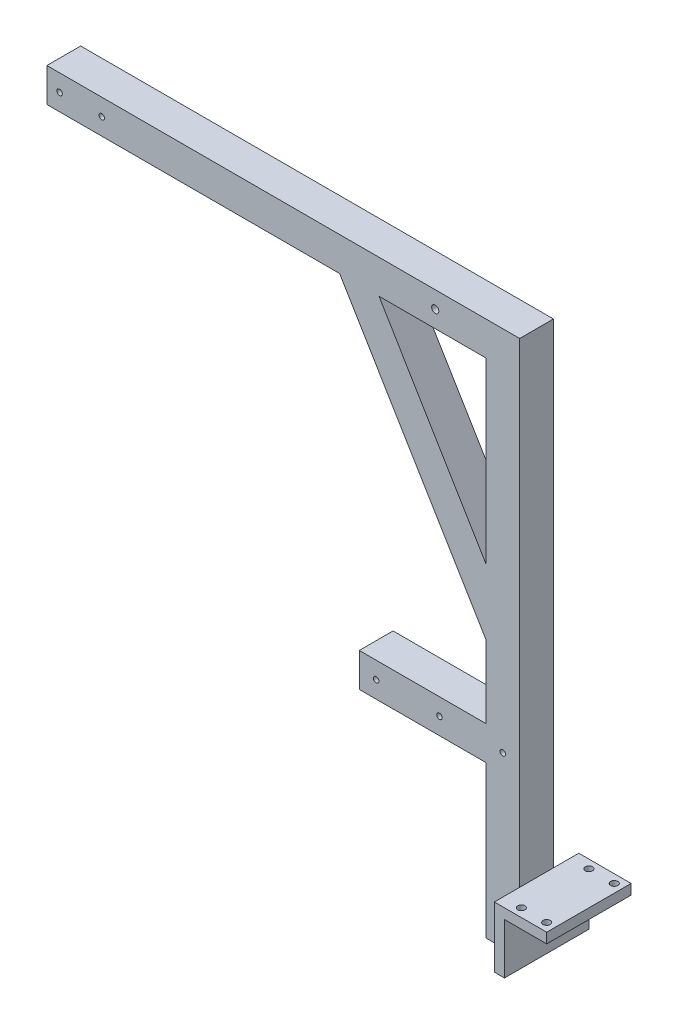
ISO-10303-21;
HEADER;
FILE_DESCRIPTION(('STEP AP214'),'2;1');
FILE_NAME('part.step','',(''),(''),'','','');
FILE_SCHEMA(('AUTOMOTIVE_DESIGN { 1 0 10303 214 1 1 1 1 }'));
ENDSEC;
DATA;
#1=APPLICATION_CONTEXT('core data for automotive mechanical design processes');
#2=APPLICATION_PROTOCOL_DEFINITION('international standard','automotive_design',2000,#1);
#3=PRODUCT_CONTEXT('',#1,'mechanical');
#4=PRODUCT('Part','Part','',(#3));
#5=PRODUCT_RELATED_PRODUCT_CATEGORY('part','',(#4));
#6=PRODUCT_DEFINITION_FORMATION('','',#4);
#7=PRODUCT_DEFINITION_CONTEXT('part definition',#1,'design');
#8=PRODUCT_DEFINITION('design','',#6,#7);
#9=PRODUCT_DEFINITION_SHAPE('','',#8);
#10=(LENGTH_UNIT() NAMED_UNIT(*) SI_UNIT(.MILLI.,.METRE.));
#11=(NAMED_UNIT(*) PLANE_ANGLE_UNIT() SI_UNIT($,.RADIAN.));
#12=(NAMED_UNIT(*) SI_UNIT($,.STERADIAN.) SOLID_ANGLE_UNIT());
#13=UNCERTAINTY_MEASURE_WITH_UNIT(LENGTH_MEASURE(1.E-05),#10,'distance_accuracy_value','');
#14=(GEOMETRIC_REPRESENTATION_CONTEXT(3) GLOBAL_UNCERTAINTY_ASSIGNED_CONTEXT((#13)) GLOBAL_UNIT_ASSIGNED_CONTEXT((#10,
#11,#12)) REPRESENTATION_CONTEXT('',''));
#15=CARTESIAN_POINT('',(0.,0.,0.));
#16=DIRECTION('',(0.,0.,1.));
#17=DIRECTION('',(1.,0.,0.));
#18=AXIS2_PLACEMENT_3D('',#15,#16,#17);
#19=CARTESIAN_POINT('',(560.,71.9999999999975,100.));
#20=DIRECTION('',(0.,0.,1.));
#21=DIRECTION('',(1.,0.,0.));
#22=AXIS2_PLACEMENT_3D('',#19,#20,#21);
#23=PLANE('',#22);
#24=DIRECTION('',(-1.,0.,0.));
#25=VECTOR('',#24,1.);
#26=CARTESIAN_POINT('',(560.,71.9999999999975,100.));
#27=LINE('',#26,#25);
#28=CARTESIAN_POINT('',(622.,71.9999999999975,100.));
#29=VERTEX_POINT('',#28);
#30=CARTESIAN_POINT('',(559.999999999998,71.9999999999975,100.));
#31=VERTEX_POINT('',#30);
#32=EDGE_CURVE('E192',#29,#31,#27,.T.);
#33=ORIENTED_EDGE('',*,*,#32,.T.);
#34=DIRECTION('',(0.,1.,0.));
#35=VECTOR('',#34,1.);
#36=CARTESIAN_POINT('',(559.999999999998,-2.77555756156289E-12,100.));
#37=LINE('',#36,#35);
#38=CARTESIAN_POINT('',(559.999999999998,-2.77555756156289E-12,100.));
#39=VERTEX_POINT('',#38);
#40=EDGE_CURVE('E180',#39,#31,#37,.T.);
#41=ORIENTED_EDGE('',*,*,#40,.F.);
#42=DIRECTION('',(1.,0.,0.));
#43=VECTOR('',#42,1.);
#44=CARTESIAN_POINT('',(520.,-2.50111042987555E-12,100.));
#45=LINE('',#44,#43);
#46=CARTESIAN_POINT('',(572.,-2.72848410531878E-12,100.));
#47=VERTEX_POINT('',#46);
#48=EDGE_CURVE('E189',#39,#47,#45,.T.);
#49=ORIENTED_EDGE('',*,*,#48,.T.);
#50=DIRECTION('',(0.,1.,0.));
#51=VECTOR('',#50,1.);
#52=CARTESIAN_POINT('',(572.,-2.72848410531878E-12,100.));
#53=LINE('',#52,#51);
#54=CARTESIAN_POINT('',(572.,59.9999999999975,100.));
#55=VERTEX_POINT('',#54);
#56=EDGE_CURVE('E201',#47,#55,#53,.T.);
#57=ORIENTED_EDGE('',*,*,#56,.T.);
#58=DIRECTION('',(1.,0.,0.));
#59=VECTOR('',#58,1.);
#60=CARTESIAN_POINT('',(572.,59.9999999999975,100.));
#61=LINE('',#60,#59);
#62=CARTESIAN_POINT('',(622.,59.9999999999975,100.));
#63=VERTEX_POINT('',#62);
#64=EDGE_CURVE('E204',#55,#63,#61,.T.);
#65=ORIENTED_EDGE('',*,*,#64,.T.);
#66=DIRECTION('',(0.,1.,0.));
#67=VECTOR('',#66,1.);
#68=CARTESIAN_POINT('',(622.,59.9999999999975,100.));
#69=LINE('',#68,#67);
#70=EDGE_CURVE('E214',#63,#29,#69,.T.);
#71=ORIENTED_EDGE('',*,*,#70,.T.);
#72=EDGE_LOOP('',(#33,#41,#49,#57,#65,#71));
#73=FACE_BOUND('',#72,.T.);
#74=ADVANCED_FACE('F33',(#73),#23,.T.);
#75=CARTESIAN_POINT('',(560.,71.9999999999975,0.));
#76=DIRECTION('',(0.,0.,1.));
#77=DIRECTION('',(1.,0.,0.));
#78=AXIS2_PLACEMENT_3D('',#75,#76,#77);
#79=PLANE('',#78);
#80=DIRECTION('',(0.,1.,0.));
#81=VECTOR('',#80,1.);
#82=CARTESIAN_POINT('',(559.999999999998,-2.77555756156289E-12,0.));
#83=LINE('',#82,#81);
#84=CARTESIAN_POINT('',(559.999999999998,-2.77555756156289E-12,0.));
#85=VERTEX_POINT('',#84);
#86=CARTESIAN_POINT('',(559.999999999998,71.9999999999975,0.));
#87=VERTEX_POINT('',#86);
#88=EDGE_CURVE('E194',#85,#87,#83,.T.);
#89=ORIENTED_EDGE('',*,*,#88,.T.);
#90=DIRECTION('',(-1.,0.,0.));
#91=VECTOR('',#90,1.);
#92=CARTESIAN_POINT('',(560.,71.9999999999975,0.));
#93=LINE('',#92,#91);
#94=CARTESIAN_POINT('',(622.,71.9999999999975,0.));
#95=VERTEX_POINT('',#94);
#96=EDGE_CURVE('E202',#95,#87,#93,.T.);
#97=ORIENTED_EDGE('',*,*,#96,.F.);
#98=DIRECTION('',(0.,1.,0.));
#99=VECTOR('',#98,1.);
#100=CARTESIAN_POINT('',(622.,59.9999999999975,0.));
#101=LINE('',#100,#99);
#102=CARTESIAN_POINT('',(622.,59.9999999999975,0.));
#103=VERTEX_POINT('',#102);
#104=EDGE_CURVE('E207',#103,#95,#101,.T.);
#105=ORIENTED_EDGE('',*,*,#104,.F.);
#106=DIRECTION('',(1.,0.,0.));
#107=VECTOR('',#106,1.);
#108=CARTESIAN_POINT('',(572.,59.9999999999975,0.));
#109=LINE('',#108,#107);
#110=CARTESIAN_POINT('',(572.,59.9999999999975,0.));
#111=VERTEX_POINT('',#110);
#112=EDGE_CURVE('E222',#111,#103,#109,.T.);
#113=ORIENTED_EDGE('',*,*,#112,.F.);
#114=DIRECTION('',(0.,1.,0.));
#115=VECTOR('',#114,1.);
#116=CARTESIAN_POINT('',(572.,-2.72848410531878E-12,0.));
#117=LINE('',#116,#115);
#118=CARTESIAN_POINT('',(572.,-2.72848410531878E-12,0.));
#119=VERTEX_POINT('',#118);
#120=EDGE_CURVE('E220',#119,#111,#117,.T.);
#121=ORIENTED_EDGE('',*,*,#120,.F.);
#122=DIRECTION('',(1.,0.,0.));
#123=VECTOR('',#122,1.);
#124=CARTESIAN_POINT('',(520.,-2.50111042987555E-12,0.));
#125=LINE('',#124,#123);
#126=EDGE_CURVE('E218',#85,#119,#125,.T.);
#127=ORIENTED_EDGE('',*,*,#126,.F.);
#128=EDGE_LOOP('',(#89,#97,#105,#113,#121,#127));
#129=FACE_BOUND('',#128,.T.);
#130=ADVANCED_FACE('F447',(#129),#79,.F.);
#131=CARTESIAN_POINT('',(0.,634.999999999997,100.));
#132=DIRECTION('',(0.,-1.,0.));
#133=DIRECTION('',(0.,0.,-1.));
#134=AXIS2_PLACEMENT_3D('',#131,#132,#133);
#135=PLANE('',#134);
#136=DIRECTION('',(-1.,0.,0.));
#137=VECTOR('',#136,1.);
#138=CARTESIAN_POINT('',(-1.81898940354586E-12,634.999999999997,30.));
#139=LINE('',#138,#137);
#140=CARTESIAN_POINT('',(560.,634.999999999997,30.));
#141=VERTEX_POINT('',#140);
#142=CARTESIAN_POINT('',(-1.81898940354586E-12,634.999999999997,30.));
#143=VERTEX_POINT('',#142);
#144=EDGE_CURVE('E58',#141,#143,#139,.T.);
#145=ORIENTED_EDGE('',*,*,#144,.T.);
#146=DIRECTION('',(0.,0.,-1.));
#147=VECTOR('',#146,1.);
#148=CARTESIAN_POINT('',(0.,634.999999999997,100.));
#149=LINE('',#148,#147);
#150=CARTESIAN_POINT('',(-1.83186799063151E-12,634.999999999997,70.));
#151=VERTEX_POINT('',#150);
#152=EDGE_CURVE('E262',#151,#143,#149,.T.);
#153=ORIENTED_EDGE('',*,*,#152,.F.);
#154=DIRECTION('',(1.,0.,0.));
#155=VECTOR('',#154,1.);
#156=CARTESIAN_POINT('',(-1.81898940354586E-12,634.999999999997,70.));
#157=LINE('',#156,#155);
#158=CARTESIAN_POINT('',(559.999999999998,634.999999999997,70.));
#159=VERTEX_POINT('',#158);
#160=EDGE_CURVE('E290',#151,#159,#157,.T.);
#161=ORIENTED_EDGE('',*,*,#160,.T.);
#162=DIRECTION('',(0.,0.,-1.));
#163=VECTOR('',#162,1.);
#164=CARTESIAN_POINT('',(560.,634.999999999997,100.));
#165=LINE('',#164,#163);
#166=EDGE_CURVE('E265',#159,#141,#165,.T.);
#167=ORIENTED_EDGE('',*,*,#166,.T.);
#168=EDGE_LOOP('',(#145,#153,#161,#167));
#169=FACE_BOUND('',#168,.T.);
#170=ADVANCED_FACE('F35',(#169),#135,.F.);
#171=CARTESIAN_POINT('',(0.,634.999999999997,100.));
#172=DIRECTION('',(1.,0.,0.));
#173=DIRECTION('',(0.,0.,-1.));
#174=AXIS2_PLACEMENT_3D('',#171,#172,#173);
#175=PLANE('',#174);
#176=DIRECTION('',(0.,1.,0.));
#177=VECTOR('',#176,1.);
#178=CARTESIAN_POINT('',(-1.81898940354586E-12,-2.77555756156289E-12,30.));
#179=LINE('',#178,#177);
#180=CARTESIAN_POINT('',(-1.81898940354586E-12,594.999999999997,30.));
#181=VERTEX_POINT('',#180);
#182=EDGE_CURVE('E333',#181,#143,#179,.T.);
#183=ORIENTED_EDGE('',*,*,#182,.F.);
#184=DIRECTION('',(0.,0.,-1.));
#185=VECTOR('',#184,1.);
#186=CARTESIAN_POINT('',(0.,594.999999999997,100.));
#187=LINE('',#186,#185);
#188=CARTESIAN_POINT('',(-1.81898940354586E-12,594.999999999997,70.));
#189=VERTEX_POINT('',#188);
#190=EDGE_CURVE('E259',#189,#181,#187,.T.);
#191=ORIENTED_EDGE('',*,*,#190,.F.);
#192=DIRECTION('',(0.,1.,0.));
#193=VECTOR('',#192,1.);
#194=CARTESIAN_POINT('',(-1.81898940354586E-12,-2.77555756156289E-12,70.));
#195=LINE('',#194,#193);
#196=EDGE_CURVE('E329',#189,#151,#195,.T.);
#197=ORIENTED_EDGE('',*,*,#196,.T.);
#198=ORIENTED_EDGE('',*,*,#152,.T.);
#199=EDGE_LOOP('',(#183,#191,#197,#198));
#200=FACE_BOUND('',#199,.T.);
#201=ADVANCED_FACE('F428',(#200),#175,.F.);
#202=CARTESIAN_POINT('',(0.,594.999999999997,100.));
#203=DIRECTION('',(0.,1.,0.));
#204=DIRECTION('',(0.,0.,1.));
#205=AXIS2_PLACEMENT_3D('',#202,#203,#204);
#206=PLANE('',#205);
#207=DIRECTION('',(-1.,0.,0.));
#208=VECTOR('',#207,1.);
#209=CARTESIAN_POINT('',(0.,594.999999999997,30.));
#210=LINE('',#209,#208);
#211=CARTESIAN_POINT('',(346.676192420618,594.999999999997,30.));
#212=VERTEX_POINT('',#211);
#213=EDGE_CURVE('E284',#212,#181,#210,.T.);
#214=ORIENTED_EDGE('',*,*,#213,.F.);
#215=DIRECTION('',(0.,0.,-1.));
#216=VECTOR('',#215,1.);
#217=CARTESIAN_POINT('',(346.676192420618,594.999999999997,100.));
#218=LINE('',#217,#216);
#219=CARTESIAN_POINT('',(346.676192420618,594.999999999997,70.));
#220=VERTEX_POINT('',#219);
#221=EDGE_CURVE('E256',#220,#212,#218,.T.);
#222=ORIENTED_EDGE('',*,*,#221,.F.);
#223=DIRECTION('',(1.,0.,0.));
#224=VECTOR('',#223,1.);
#225=CARTESIAN_POINT('',(0.,594.999999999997,70.));
#226=LINE('',#225,#224);
#227=EDGE_CURVE('E363',#189,#220,#226,.T.);
#228=ORIENTED_EDGE('',*,*,#227,.F.);
#229=ORIENTED_EDGE('',*,*,#190,.T.);
#230=EDGE_LOOP('',(#214,#222,#228,#229));
#231=FACE_BOUND('',#230,.T.);
#232=ADVANCED_FACE('F425',(#231),#206,.F.);
#233=CARTESIAN_POINT('',(346.676192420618,594.999999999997,100.));
#234=DIRECTION('',(0.857492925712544,0.514495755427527,0.));
#235=DIRECTION('',(-0.514495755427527,0.857492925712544,0.));
#236=AXIS2_PLACEMENT_3D('',#233,#234,#235);
#237=PLANE('',#236);
#238=DIRECTION('',(-0.514495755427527,0.857492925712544,0.));
#239=VECTOR('',#238,1.);
#240=CARTESIAN_POINT('',(346.676192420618,594.999999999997,30.));
#241=LINE('',#240,#239);
#242=CARTESIAN_POINT('',(520.,306.126987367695,30.));
#243=VERTEX_POINT('',#242);
#244=EDGE_CURVE('E381',#243,#212,#241,.T.);
#245=ORIENTED_EDGE('',*,*,#244,.F.);
#246=DIRECTION('',(0.,0.,-1.));
#247=VECTOR('',#246,1.);
#248=CARTESIAN_POINT('',(520.,306.126987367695,100.));
#249=LINE('',#248,#247);
#250=CARTESIAN_POINT('',(520.,306.126987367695,70.));
#251=VERTEX_POINT('',#250);
#252=EDGE_CURVE('E253',#251,#243,#249,.T.);
#253=ORIENTED_EDGE('',*,*,#252,.F.);
#254=DIRECTION('',(0.514495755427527,-0.857492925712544,0.));
#255=VECTOR('',#254,1.);
#256=CARTESIAN_POINT('',(346.676192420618,594.999999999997,70.));
#257=LINE('',#256,#255);
#258=EDGE_CURVE('E361',#220,#251,#257,.T.);
#259=ORIENTED_EDGE('',*,*,#258,.F.);
#260=ORIENTED_EDGE('',*,*,#221,.T.);
#261=EDGE_LOOP('',(#245,#253,#259,#260));
#262=FACE_BOUND('',#261,.T.);
#263=ADVANCED_FACE('F423',(#262),#237,.F.);
#264=CARTESIAN_POINT('',(520.,306.126987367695,100.));
#265=DIRECTION('',(1.,0.,0.));
#266=DIRECTION('',(0.,0.,-1.));
#267=AXIS2_PLACEMENT_3D('',#264,#265,#266);
#268=PLANE('',#267);
#269=DIRECTION('',(0.,1.,0.));
#270=VECTOR('',#269,1.);
#271=CARTESIAN_POINT('',(520.,306.126987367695,30.));
#272=LINE('',#271,#270);
#273=CARTESIAN_POINT('',(520.,219.999999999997,30.));
#274=VERTEX_POINT('',#273);
#275=EDGE_CURVE('E379',#274,#243,#272,.T.);
#276=ORIENTED_EDGE('',*,*,#275,.F.);
#277=DIRECTION('',(0.,0.,-1.));
#278=VECTOR('',#277,1.);
#279=CARTESIAN_POINT('',(520.,219.999999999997,100.));
#280=LINE('',#279,#278);
#281=CARTESIAN_POINT('',(520.,219.999999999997,70.));
#282=VERTEX_POINT('',#281);
#283=EDGE_CURVE('E250',#282,#274,#280,.T.);
#284=ORIENTED_EDGE('',*,*,#283,.F.);
#285=DIRECTION('',(0.,-1.,0.));
#286=VECTOR('',#285,1.);
#287=CARTESIAN_POINT('',(520.,306.126987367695,70.));
#288=LINE('',#287,#286);
#289=EDGE_CURVE('E359',#251,#282,#288,.T.);
#290=ORIENTED_EDGE('',*,*,#289,.F.);
#291=ORIENTED_EDGE('',*,*,#252,.T.);
#292=EDGE_LOOP('',(#276,#284,#290,#291));
#293=FACE_BOUND('',#292,.T.);
#294=ADVANCED_FACE('F474',(#293),#268,.F.);
#295=CARTESIAN_POINT('',(520.,219.999999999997,100.));
#296=DIRECTION('',(0.,-1.,0.));
#297=DIRECTION('',(0.,0.,-1.));
#298=AXIS2_PLACEMENT_3D('',#295,#296,#297);
#299=PLANE('',#298);
#300=DIRECTION('',(1.,0.,0.));
#301=VECTOR('',#300,1.);
#302=CARTESIAN_POINT('',(520.,219.999999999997,30.));
#303=LINE('',#302,#301);
#304=CARTESIAN_POINT('',(370.,219.999999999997,30.));
#305=VERTEX_POINT('',#304);
#306=EDGE_CURVE('E377',#305,#274,#303,.T.);
#307=ORIENTED_EDGE('',*,*,#306,.F.);
#308=DIRECTION('',(0.,0.,-1.));
#309=VECTOR('',#308,1.);
#310=CARTESIAN_POINT('',(370.,219.999999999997,100.));
#311=LINE('',#310,#309);
#312=CARTESIAN_POINT('',(370.,219.999999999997,70.));
#313=VERTEX_POINT('',#312);
#314=EDGE_CURVE('E247',#313,#305,#311,.T.);
#315=ORIENTED_EDGE('',*,*,#314,.F.);
#316=DIRECTION('',(-1.,0.,0.));
#317=VECTOR('',#316,1.);
#318=CARTESIAN_POINT('',(520.,219.999999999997,70.));
#319=LINE('',#318,#317);
#320=EDGE_CURVE('E357',#282,#313,#319,.T.);
#321=ORIENTED_EDGE('',*,*,#320,.F.);
#322=ORIENTED_EDGE('',*,*,#283,.T.);
#323=EDGE_LOOP('',(#307,#315,#321,#322));
#324=FACE_BOUND('',#323,.T.);
#325=ADVANCED_FACE('F470',(#324),#299,.F.);
#326=CARTESIAN_POINT('',(370.,179.999999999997,100.));
#327=DIRECTION('',(1.,0.,0.));
#328=DIRECTION('',(0.,0.,-1.));
#329=AXIS2_PLACEMENT_3D('',#326,#327,#328);
#330=PLANE('',#329);
#331=DIRECTION('',(0.,1.,0.));
#332=VECTOR('',#331,1.);
#333=CARTESIAN_POINT('',(370.,179.999999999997,30.));
#334=LINE('',#333,#332);
#335=CARTESIAN_POINT('',(370.,179.999999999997,30.));
#336=VERTEX_POINT('',#335);
#337=EDGE_CURVE('E375',#336,#305,#334,.T.);
#338=ORIENTED_EDGE('',*,*,#337,.F.);
#339=DIRECTION('',(0.,0.,-1.));
#340=VECTOR('',#339,1.);
#341=CARTESIAN_POINT('',(370.,179.999999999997,100.));
#342=LINE('',#341,#340);
#343=CARTESIAN_POINT('',(370.,179.999999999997,70.));
#344=VERTEX_POINT('',#343);
#345=EDGE_CURVE('E244',#344,#336,#342,.T.);
#346=ORIENTED_EDGE('',*,*,#345,.F.);
#347=DIRECTION('',(0.,-1.,0.));
#348=VECTOR('',#347,1.);
#349=CARTESIAN_POINT('',(370.,179.999999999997,70.));
#350=LINE('',#349,#348);
#351=EDGE_CURVE('E355',#313,#344,#350,.T.);
#352=ORIENTED_EDGE('',*,*,#351,.F.);
#353=ORIENTED_EDGE('',*,*,#314,.T.);
#354=EDGE_LOOP('',(#338,#346,#352,#353));
#355=FACE_BOUND('',#354,.T.);
#356=ADVANCED_FACE('F465',(#355),#330,.F.);
#357=CARTESIAN_POINT('',(520.,179.999999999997,100.));
#358=DIRECTION('',(0.,1.,0.));
#359=DIRECTION('',(0.,0.,1.));
#360=AXIS2_PLACEMENT_3D('',#357,#358,#359);
#361=PLANE('',#360);
#362=DIRECTION('',(-1.,0.,0.));
#363=VECTOR('',#362,1.);
#364=CARTESIAN_POINT('',(520.,179.999999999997,30.));
#365=LINE('',#364,#363);
#366=CARTESIAN_POINT('',(520.,179.999999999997,30.));
#367=VERTEX_POINT('',#366);
#368=EDGE_CURVE('E373',#367,#336,#365,.T.);
#369=ORIENTED_EDGE('',*,*,#368,.F.);
#370=DIRECTION('',(0.,0.,-1.));
#371=VECTOR('',#370,1.);
#372=CARTESIAN_POINT('',(520.,179.999999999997,100.));
#373=LINE('',#372,#371);
#374=CARTESIAN_POINT('',(520.,179.999999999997,70.));
#375=VERTEX_POINT('',#374);
#376=EDGE_CURVE('E241',#375,#367,#373,.T.);
#377=ORIENTED_EDGE('',*,*,#376,.F.);
#378=DIRECTION('',(1.,0.,0.));
#379=VECTOR('',#378,1.);
#380=CARTESIAN_POINT('',(520.,179.999999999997,70.));
#381=LINE('',#380,#379);
#382=EDGE_CURVE('E353',#344,#375,#381,.T.);
#383=ORIENTED_EDGE('',*,*,#382,.F.);
#384=ORIENTED_EDGE('',*,*,#345,.T.);
#385=EDGE_LOOP('',(#369,#377,#383,#384));
#386=FACE_BOUND('',#385,.T.);
#387=ADVANCED_FACE('F460',(#386),#361,.F.);
#388=CARTESIAN_POINT('',(520.,-2.50111042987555E-12,100.));
#389=DIRECTION('',(1.,0.,0.));
#390=DIRECTION('',(0.,0.,-1.));
#391=AXIS2_PLACEMENT_3D('',#388,#389,#390);
#392=PLANE('',#391);
#393=DIRECTION('',(0.,1.,0.));
#394=VECTOR('',#393,1.);
#395=CARTESIAN_POINT('',(520.,-2.50111042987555E-12,30.));
#396=LINE('',#395,#394);
#397=CARTESIAN_POINT('',(520.,-2.77555756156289E-12,30.));
#398=VERTEX_POINT('',#397);
#399=EDGE_CURVE('E371',#398,#367,#396,.T.);
#400=ORIENTED_EDGE('',*,*,#399,.F.);
#401=DIRECTION('',(0.,0.,-1.));
#402=VECTOR('',#401,1.);
#403=CARTESIAN_POINT('',(520.,-2.50111042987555E-12,100.));
#404=LINE('',#403,#402);
#405=CARTESIAN_POINT('',(520.,-2.77555756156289E-12,70.));
#406=VERTEX_POINT('',#405);
#407=EDGE_CURVE('E238',#406,#398,#404,.T.);
#408=ORIENTED_EDGE('',*,*,#407,.F.);
#409=DIRECTION('',(0.,-1.,0.));
#410=VECTOR('',#409,1.);
#411=CARTESIAN_POINT('',(520.,-2.50111042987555E-12,70.));
#412=LINE('',#411,#410);
#413=EDGE_CURVE('E351',#375,#406,#412,.T.);
#414=ORIENTED_EDGE('',*,*,#413,.F.);
#415=ORIENTED_EDGE('',*,*,#376,.T.);
#416=EDGE_LOOP('',(#400,#408,#414,#415));
#417=FACE_BOUND('',#416,.T.);
#418=ADVANCED_FACE('F455',(#417),#392,.F.);
#419=CARTESIAN_POINT('',(520.,-2.50111042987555E-12,100.));
#420=DIRECTION('',(0.,1.,0.));
#421=DIRECTION('',(-1.,0.,0.));
#422=AXIS2_PLACEMENT_3D('',#419,#420,#421);
#423=PLANE('',#422);
#424=DIRECTION('',(-1.,0.,0.));
#425=VECTOR('',#424,1.);
#426=CARTESIAN_POINT('',(-1.81898940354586E-12,-2.77555756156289E-12,30.));
#427=LINE('',#426,#425);
#428=CARTESIAN_POINT('',(559.999999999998,-2.77555756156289E-12,30.));
#429=VERTEX_POINT('',#428);
#430=EDGE_CURVE('E327',#429,#398,#427,.T.);
#431=ORIENTED_EDGE('',*,*,#430,.F.);
#432=DIRECTION('',(0.,0.,1.));
#433=VECTOR('',#432,1.);
#434=CARTESIAN_POINT('',(559.999999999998,-2.77555756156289E-12,30.));
#435=LINE('',#434,#433);
#436=EDGE_CURVE('E185',#85,#429,#435,.T.);
#437=ORIENTED_EDGE('',*,*,#436,.F.);
#438=ORIENTED_EDGE('',*,*,#126,.T.);
#439=DIRECTION('',(0.,0.,-1.));
#440=VECTOR('',#439,1.);
#441=CARTESIAN_POINT('',(572.,-2.72848410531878E-12,100.));
#442=LINE('',#441,#440);
#443=EDGE_CURVE('E199',#47,#119,#442,.T.);
#444=ORIENTED_EDGE('',*,*,#443,.F.);
#445=ORIENTED_EDGE('',*,*,#48,.F.);
#446=DIRECTION('',(0.,0.,1.));
#447=VECTOR('',#446,1.);
#448=CARTESIAN_POINT('',(559.999999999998,-2.77555756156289E-12,100.));
#449=LINE('',#448,#447);
#450=CARTESIAN_POINT('',(559.999999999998,-2.77555756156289E-12,70.));
#451=VERTEX_POINT('',#450);
#452=EDGE_CURVE('E177',#451,#39,#449,.T.);
#453=ORIENTED_EDGE('',*,*,#452,.F.);
#454=DIRECTION('',(1.,0.,0.));
#455=VECTOR('',#454,1.);
#456=CARTESIAN_POINT('',(-1.81898940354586E-12,-2.77555756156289E-12,70.));
#457=LINE('',#456,#455);
#458=EDGE_CURVE('E186',#406,#451,#457,.T.);
#459=ORIENTED_EDGE('',*,*,#458,.F.);
#460=ORIENTED_EDGE('',*,*,#407,.T.);
#461=EDGE_LOOP('',(#431,#437,#438,#444,#445,#453,#459,#460));
#462=FACE_BOUND('',#461,.T.);
#463=ADVANCED_FACE('F197',(#462),#423,.F.);
#464=CARTESIAN_POINT('',(560.,71.9999999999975,100.));
#465=DIRECTION('',(-1.,0.,0.));
#466=DIRECTION('',(0.,0.,1.));
#467=AXIS2_PLACEMENT_3D('',#464,#465,#466);
#468=PLANE('',#467);
#469=DIRECTION('',(0.,1.,0.));
#470=VECTOR('',#469,1.);
#471=CARTESIAN_POINT('',(559.999999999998,-2.77555756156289E-12,30.));
#472=LINE('',#471,#470);
#473=CARTESIAN_POINT('',(559.999999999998,71.9999999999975,30.));
#474=VERTEX_POINT('',#473);
#475=EDGE_CURVE('E339',#474,#141,#472,.T.);
#476=ORIENTED_EDGE('',*,*,#475,.T.);
#477=ORIENTED_EDGE('',*,*,#166,.F.);
#478=DIRECTION('',(0.,1.,0.));
#479=VECTOR('',#478,1.);
#480=CARTESIAN_POINT('',(559.999999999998,-2.77555756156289E-12,70.));
#481=LINE('',#480,#479);
#482=CARTESIAN_POINT('',(560.,71.9999999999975,70.));
#483=VERTEX_POINT('',#482);
#484=EDGE_CURVE('E343',#483,#159,#481,.T.);
#485=ORIENTED_EDGE('',*,*,#484,.F.);
#486=DIRECTION('',(0.,0.,-1.));
#487=VECTOR('',#486,1.);
#488=CARTESIAN_POINT('',(560.,71.9999999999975,100.));
#489=LINE('',#488,#487);
#490=EDGE_CURVE('E228',#483,#474,#489,.T.);
#491=ORIENTED_EDGE('',*,*,#490,.T.);
#492=EDGE_LOOP('',(#476,#477,#485,#491));
#493=FACE_BOUND('',#492,.T.);
#494=ADVANCED_FACE('F434',(#493),#468,.F.);
#495=CARTESIAN_POINT('',(572.,-2.72848410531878E-12,100.));
#496=DIRECTION('',(-1.,0.,0.));
#497=DIRECTION('',(0.,0.,1.));
#498=AXIS2_PLACEMENT_3D('',#495,#496,#497);
#499=PLANE('',#498);
#500=ORIENTED_EDGE('',*,*,#120,.T.);
#501=DIRECTION('',(0.,0.,-1.));
#502=VECTOR('',#501,1.);
#503=CARTESIAN_POINT('',(572.,59.9999999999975,100.));
#504=LINE('',#503,#502);
#505=EDGE_CURVE('E234',#55,#111,#504,.T.);
#506=ORIENTED_EDGE('',*,*,#505,.F.);
#507=ORIENTED_EDGE('',*,*,#56,.F.);
#508=ORIENTED_EDGE('',*,*,#443,.T.);
#509=EDGE_LOOP('',(#500,#506,#507,#508));
#510=FACE_BOUND('',#509,.T.);
#511=ADVANCED_FACE('F494',(#510),#499,.F.);
#512=CARTESIAN_POINT('',(572.,59.9999999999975,100.));
#513=DIRECTION('',(0.,1.,0.));
#514=DIRECTION('',(0.,0.,1.));
#515=AXIS2_PLACEMENT_3D('',#512,#513,#514);
#516=PLANE('',#515);
#517=CARTESIAN_POINT('',(581.999999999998,59.9999999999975,90.));
#518=DIRECTION('',(0.,1.,0.));
#519=DIRECTION('',(0.,0.,1.));
#520=AXIS2_PLACEMENT_3D('',#517,#518,#519);
#521=CIRCLE('',#520,4.24999999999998);
#522=CARTESIAN_POINT('',(581.999999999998,59.9999999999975,94.25));
#523=VERTEX_POINT('',#522);
#524=EDGE_CURVE('E280',#523,#523,#521,.T.);
#525=ORIENTED_EDGE('',*,*,#524,.T.);
#526=EDGE_LOOP('',(#525));
#527=FACE_BOUND('',#526,.T.);
#528=CARTESIAN_POINT('',(611.999999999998,59.9999999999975,90.));
#529=DIRECTION('',(0.,1.,0.));
#530=DIRECTION('',(0.,0.,1.));
#531=AXIS2_PLACEMENT_3D('',#528,#529,#530);
#532=CIRCLE('',#531,4.24999999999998);
#533=CARTESIAN_POINT('',(611.999999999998,59.9999999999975,94.25));
#534=VERTEX_POINT('',#533);
#535=EDGE_CURVE('E276',#534,#534,#532,.T.);
#536=ORIENTED_EDGE('',*,*,#535,.T.);
#537=EDGE_LOOP('',(#536));
#538=FACE_BOUND('',#537,.T.);
#539=CARTESIAN_POINT('',(611.999999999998,59.9999999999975,10.));
#540=DIRECTION('',(0.,1.,0.));
#541=DIRECTION('',(0.,0.,1.));
#542=AXIS2_PLACEMENT_3D('',#539,#540,#541);
#543=CIRCLE('',#542,4.24999999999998);
#544=CARTESIAN_POINT('',(611.999999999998,59.9999999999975,14.25));
#545=VERTEX_POINT('',#544);
#546=EDGE_CURVE('E272',#545,#545,#543,.T.);
#547=ORIENTED_EDGE('',*,*,#546,.T.);
#548=EDGE_LOOP('',(#547));
#549=FACE_BOUND('',#548,.T.);
#550=CARTESIAN_POINT('',(581.999999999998,59.9999999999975,10.));
#551=DIRECTION('',(0.,1.,0.));
#552=DIRECTION('',(0.,0.,1.));
#553=AXIS2_PLACEMENT_3D('',#550,#551,#552);
#554=CIRCLE('',#553,4.24999999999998);
#555=CARTESIAN_POINT('',(581.999999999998,59.9999999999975,14.25));
#556=VERTEX_POINT('',#555);
#557=EDGE_CURVE('E271',#556,#556,#554,.T.);
#558=ORIENTED_EDGE('',*,*,#557,.T.);
#559=EDGE_LOOP('',(#558));
#560=FACE_BOUND('',#559,.T.);
#561=ORIENTED_EDGE('',*,*,#112,.T.);
#562=DIRECTION('',(0.,0.,-1.));
#563=VECTOR('',#562,1.);
#564=CARTESIAN_POINT('',(622.,59.9999999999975,100.));
#565=LINE('',#564,#563);
#566=EDGE_CURVE('E231',#63,#103,#565,.T.);
#567=ORIENTED_EDGE('',*,*,#566,.F.);
#568=ORIENTED_EDGE('',*,*,#64,.F.);
#569=ORIENTED_EDGE('',*,*,#505,.T.);
#570=EDGE_LOOP('',(#561,#567,#568,#569));
#571=FACE_BOUND('',#570,.T.);
#572=ADVANCED_FACE('F502',(#527,#538,#549,#560,#571),#516,.F.);
#573=CARTESIAN_POINT('',(622.,59.9999999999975,100.));
#574=DIRECTION('',(-1.,0.,0.));
#575=DIRECTION('',(0.,0.,1.));
#576=AXIS2_PLACEMENT_3D('',#573,#574,#575);
#577=PLANE('',#576);
#578=ORIENTED_EDGE('',*,*,#104,.T.);
#579=DIRECTION('',(0.,0.,-1.));
#580=VECTOR('',#579,1.);
#581=CARTESIAN_POINT('',(622.,71.9999999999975,100.));
#582=LINE('',#581,#580);
#583=EDGE_CURVE('E227',#29,#95,#582,.T.);
#584=ORIENTED_EDGE('',*,*,#583,.F.);
#585=ORIENTED_EDGE('',*,*,#70,.F.);
#586=ORIENTED_EDGE('',*,*,#566,.T.);
#587=EDGE_LOOP('',(#578,#584,#585,#586));
#588=FACE_BOUND('',#587,.T.);
#589=ADVANCED_FACE('F498',(#588),#577,.F.);
#590=CARTESIAN_POINT('',(560.,71.9999999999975,100.));
#591=DIRECTION('',(0.,-1.,0.));
#592=DIRECTION('',(0.,0.,-1.));
#593=AXIS2_PLACEMENT_3D('',#590,#591,#592);
#594=PLANE('',#593);
#595=CARTESIAN_POINT('',(581.999999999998,71.9999999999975,90.));
#596=DIRECTION('',(0.,-1.,0.));
#597=DIRECTION('',(0.,0.,-1.));
#598=AXIS2_PLACEMENT_3D('',#595,#596,#597);
#599=CIRCLE('',#598,4.24999999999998);
#600=CARTESIAN_POINT('',(581.999999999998,71.9999999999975,94.25));
#601=VERTEX_POINT('',#600);
#602=EDGE_CURVE('E281',#601,#601,#599,.T.);
#603=ORIENTED_EDGE('',*,*,#602,.T.);
#604=EDGE_LOOP('',(#603));
#605=FACE_BOUND('',#604,.T.);
#606=CARTESIAN_POINT('',(611.999999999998,71.9999999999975,90.));
#607=DIRECTION('',(0.,-1.,0.));
#608=DIRECTION('',(0.,0.,-1.));
#609=AXIS2_PLACEMENT_3D('',#606,#607,#608);
#610=CIRCLE('',#609,4.24999999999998);
#611=CARTESIAN_POINT('',(611.999999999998,71.9999999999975,94.25));
#612=VERTEX_POINT('',#611);
#613=EDGE_CURVE('E277',#612,#612,#610,.T.);
#614=ORIENTED_EDGE('',*,*,#613,.T.);
#615=EDGE_LOOP('',(#614));
#616=FACE_BOUND('',#615,.T.);
#617=CARTESIAN_POINT('',(611.999999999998,71.9999999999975,10.));
#618=DIRECTION('',(0.,-1.,0.));
#619=DIRECTION('',(0.,0.,-1.));
#620=AXIS2_PLACEMENT_3D('',#617,#618,#619);
#621=CIRCLE('',#620,4.24999999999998);
#622=CARTESIAN_POINT('',(611.999999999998,71.9999999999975,14.25));
#623=VERTEX_POINT('',#622);
#624=EDGE_CURVE('E273',#623,#623,#621,.T.);
#625=ORIENTED_EDGE('',*,*,#624,.T.);
#626=EDGE_LOOP('',(#625));
#627=FACE_BOUND('',#626,.T.);
#628=CARTESIAN_POINT('',(581.999999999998,71.9999999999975,10.));
#629=DIRECTION('',(0.,-1.,0.));
#630=DIRECTION('',(0.,0.,-1.));
#631=AXIS2_PLACEMENT_3D('',#628,#629,#630);
#632=CIRCLE('',#631,4.24999999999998);
#633=CARTESIAN_POINT('',(581.999999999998,71.9999999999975,14.25));
#634=VERTEX_POINT('',#633);
#635=EDGE_CURVE('E268',#634,#634,#632,.T.);
#636=ORIENTED_EDGE('',*,*,#635,.T.);
#637=EDGE_LOOP('',(#636));
#638=FACE_BOUND('',#637,.T.);
#639=ORIENTED_EDGE('',*,*,#96,.T.);
#640=EDGE_CURVE('E217',#474,#87,#489,.T.);
#641=ORIENTED_EDGE('',*,*,#640,.F.);
#642=ORIENTED_EDGE('',*,*,#490,.F.);
#643=EDGE_CURVE('E225',#31,#483,#489,.T.);
#644=ORIENTED_EDGE('',*,*,#643,.F.);
#645=ORIENTED_EDGE('',*,*,#32,.F.);
#646=ORIENTED_EDGE('',*,*,#583,.T.);
#647=EDGE_LOOP('',(#639,#641,#642,#644,#645,#646));
#648=FACE_BOUND('',#647,.T.);
#649=ADVANCED_FACE('F442',(#605,#616,#627,#638,#648),#594,.F.);
#650=CARTESIAN_POINT('',(581.999999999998,-2.77555756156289E-12,10.));
#651=DIRECTION('',(0.,1.,0.));
#652=DIRECTION('',(0.,0.,1.));
#653=AXIS2_PLACEMENT_3D('',#650,#651,#652);
#654=CYLINDRICAL_SURFACE('',#653,4.24999999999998);
#655=CARTESIAN_POINT('',(581.999999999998,71.9999999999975,14.25));
#656=CARTESIAN_POINT('',(581.999999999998,71.8749999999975,14.25));
#657=CARTESIAN_POINT('',(581.999999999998,71.7499999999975,14.25));
#658=CARTESIAN_POINT('',(581.999999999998,71.4999999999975,14.25));
#659=CARTESIAN_POINT('',(581.999999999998,71.3749999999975,14.25));
#660=CARTESIAN_POINT('',(581.999999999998,71.1249999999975,14.25));
#661=CARTESIAN_POINT('',(581.999999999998,70.9999999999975,14.25));
#662=CARTESIAN_POINT('',(581.999999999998,70.7499999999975,14.25));
#663=CARTESIAN_POINT('',(581.999999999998,70.6249999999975,14.25));
#664=CARTESIAN_POINT('',(581.999999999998,70.3749999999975,14.25));
#665=CARTESIAN_POINT('',(581.999999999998,70.2499999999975,14.25));
#666=CARTESIAN_POINT('',(581.999999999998,69.9999999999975,14.25));
#667=CARTESIAN_POINT('',(581.999999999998,69.8749999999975,14.25));
#668=CARTESIAN_POINT('',(581.999999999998,69.6249999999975,14.25));
#669=CARTESIAN_POINT('',(581.999999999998,69.4999999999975,14.25));
#670=CARTESIAN_POINT('',(581.999999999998,69.2499999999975,14.25));
#671=CARTESIAN_POINT('',(581.999999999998,69.1249999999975,14.25));
#672=CARTESIAN_POINT('',(581.999999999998,68.8749999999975,14.25));
#673=CARTESIAN_POINT('',(581.999999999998,68.7499999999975,14.25));
#674=CARTESIAN_POINT('',(581.999999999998,68.4999999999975,14.25));
#675=CARTESIAN_POINT('',(581.999999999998,68.3749999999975,14.25));
#676=CARTESIAN_POINT('',(581.999999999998,68.1249999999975,14.25));
#677=CARTESIAN_POINT('',(581.999999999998,67.9999999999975,14.25));
#678=CARTESIAN_POINT('',(581.999999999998,67.7499999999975,14.25));
#679=CARTESIAN_POINT('',(581.999999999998,67.6249999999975,14.25));
#680=CARTESIAN_POINT('',(581.999999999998,67.3749999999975,14.25));
#681=CARTESIAN_POINT('',(581.999999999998,67.2499999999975,14.25));
#682=CARTESIAN_POINT('',(581.999999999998,66.9999999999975,14.25));
#683=CARTESIAN_POINT('',(581.999999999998,66.8749999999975,14.25));
#684=CARTESIAN_POINT('',(581.999999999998,66.6249999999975,14.25));
#685=CARTESIAN_POINT('',(581.999999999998,66.4999999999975,14.25));
#686=CARTESIAN_POINT('',(581.999999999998,66.2499999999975,14.25));
#687=CARTESIAN_POINT('',(581.999999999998,66.1249999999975,14.25));
#688=CARTESIAN_POINT('',(581.999999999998,65.8749999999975,14.25));
#689=CARTESIAN_POINT('',(581.999999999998,65.7499999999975,14.25));
#690=CARTESIAN_POINT('',(581.999999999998,65.4999999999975,14.25));
#691=CARTESIAN_POINT('',(581.999999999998,65.3749999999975,14.25));
#692=CARTESIAN_POINT('',(581.999999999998,65.1249999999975,14.25));
#693=CARTESIAN_POINT('',(581.999999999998,64.9999999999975,14.25));
#694=CARTESIAN_POINT('',(581.999999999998,64.7499999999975,14.25));
#695=CARTESIAN_POINT('',(581.999999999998,64.6249999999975,14.25));
#696=CARTESIAN_POINT('',(581.999999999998,64.3749999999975,14.25));
#697=CARTESIAN_POINT('',(581.999999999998,64.2499999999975,14.25));
#698=CARTESIAN_POINT('',(581.999999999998,63.9999999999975,14.25));
#699=CARTESIAN_POINT('',(581.999999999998,63.8749999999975,14.25));
#700=CARTESIAN_POINT('',(581.999999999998,63.6249999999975,14.25));
#701=CARTESIAN_POINT('',(581.999999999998,63.4999999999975,14.25));
#702=CARTESIAN_POINT('',(581.999999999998,63.2499999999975,14.25));
#703=CARTESIAN_POINT('',(581.999999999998,63.1249999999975,14.25));
#704=CARTESIAN_POINT('',(581.999999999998,62.8749999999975,14.25));
#705=CARTESIAN_POINT('',(581.999999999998,62.7499999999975,14.25));
#706=CARTESIAN_POINT('',(581.999999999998,62.4999999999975,14.25));
#707=CARTESIAN_POINT('',(581.999999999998,62.3749999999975,14.25));
#708=CARTESIAN_POINT('',(581.999999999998,62.1249999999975,14.25));
#709=CARTESIAN_POINT('',(581.999999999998,61.9999999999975,14.25));
#710=CARTESIAN_POINT('',(581.999999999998,61.7499999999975,14.25));
#711=CARTESIAN_POINT('',(581.999999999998,61.6249999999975,14.25));
#712=CARTESIAN_POINT('',(581.999999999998,61.3749999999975,14.25));
#713=CARTESIAN_POINT('',(581.999999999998,61.2499999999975,14.25));
#714=CARTESIAN_POINT('',(581.999999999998,60.9999999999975,14.25));
#715=CARTESIAN_POINT('',(581.999999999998,60.8749999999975,14.25));
#716=CARTESIAN_POINT('',(581.999999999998,60.6249999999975,14.25));
#717=CARTESIAN_POINT('',(581.999999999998,60.4999999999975,14.25));
#718=CARTESIAN_POINT('',(581.999999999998,60.2499999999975,14.25));
#719=CARTESIAN_POINT('',(581.999999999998,60.1249999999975,14.25));
#720=CARTESIAN_POINT('',(581.999999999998,59.9999999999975,14.25));
#721=B_SPLINE_CURVE_WITH_KNOTS('',3,(#655,#656,#657,#658,#659,#660,#661,#662,#663,#664,#665,
#666,#667,#668,#669,#670,#671,#672,#673,#674,#675,#676,#677,#678,#679,#680,#681,#682,#683,#684,
#685,#686,#687,#688,#689,#690,#691,#692,#693,#694,#695,#696,#697,#698,#699,#700,#701,#702,#703,
#704,#705,#706,#707,#708,#709,#710,#711,#712,#713,#714,#715,#716,#717,#718,#719,#720),
.UNSPECIFIED.,.F.,.F.,(4,2,2,2,2,2,2,2,2,2,2,2,2,2,2,2,2,2,2,2,2,2,2,2,2,2,2,2,2,2,2,2,4),(0.,
0.375,0.750000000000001,1.125,1.5,1.875,2.25,2.625,3.,3.375,3.75,4.125,4.5,4.875,5.25,
5.62500000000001,6.00000000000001,6.37500000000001,6.75000000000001,7.12500000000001,
7.50000000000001,7.87500000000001,8.25000000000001,8.62500000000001,9.00000000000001,
9.37500000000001,9.75,10.125,10.5,10.875,11.25,11.625,12.),.UNSPECIFIED.);
#722=EDGE_CURVE('BSEAM497',#634,#556,#721,.T.);
#723=ORIENTED_EDGE('',*,*,#635,.F.);
#724=ORIENTED_EDGE('',*,*,#557,.F.);
#725=ORIENTED_EDGE('',*,*,#722,.T.);
#726=ORIENTED_EDGE('',*,*,#722,.F.);
#727=EDGE_LOOP('',(#723,#725,#724,#726));
#728=FACE_BOUND('',#727,.T.);
#729=ADVANCED_FACE('F497',(#728),#654,.F.);
#730=CARTESIAN_POINT('',(611.999999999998,-2.77555756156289E-12,10.));
#731=DIRECTION('',(0.,1.,0.));
#732=DIRECTION('',(0.,0.,1.));
#733=AXIS2_PLACEMENT_3D('',#730,#731,#732);
#734=CYLINDRICAL_SURFACE('',#733,4.24999999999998);
#735=CARTESIAN_POINT('',(611.999999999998,71.9999999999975,14.25));
#736=CARTESIAN_POINT('',(611.999999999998,71.8749999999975,14.25));
#737=CARTESIAN_POINT('',(611.999999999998,71.7499999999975,14.25));
#738=CARTESIAN_POINT('',(611.999999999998,71.4999999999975,14.25));
#739=CARTESIAN_POINT('',(611.999999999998,71.3749999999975,14.25));
#740=CARTESIAN_POINT('',(611.999999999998,71.1249999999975,14.25));
#741=CARTESIAN_POINT('',(611.999999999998,70.9999999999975,14.25));
#742=CARTESIAN_POINT('',(611.999999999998,70.7499999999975,14.25));
#743=CARTESIAN_POINT('',(611.999999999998,70.6249999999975,14.25));
#744=CARTESIAN_POINT('',(611.999999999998,70.3749999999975,14.25));
#745=CARTESIAN_POINT('',(611.999999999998,70.2499999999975,14.25));
#746=CARTESIAN_POINT('',(611.999999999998,69.9999999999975,14.25));
#747=CARTESIAN_POINT('',(611.999999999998,69.8749999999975,14.25));
#748=CARTESIAN_POINT('',(611.999999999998,69.6249999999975,14.25));
#749=CARTESIAN_POINT('',(611.999999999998,69.4999999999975,14.25));
#750=CARTESIAN_POINT('',(611.999999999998,69.2499999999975,14.25));
#751=CARTESIAN_POINT('',(611.999999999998,69.1249999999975,14.25));
#752=CARTESIAN_POINT('',(611.999999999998,68.8749999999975,14.25));
#753=CARTESIAN_POINT('',(611.999999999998,68.7499999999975,14.25));
#754=CARTESIAN_POINT('',(611.999999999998,68.4999999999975,14.25));
#755=CARTESIAN_POINT('',(611.999999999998,68.3749999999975,14.25));
#756=CARTESIAN_POINT('',(611.999999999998,68.1249999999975,14.25));
#757=CARTESIAN_POINT('',(611.999999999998,67.9999999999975,14.25));
#758=CARTESIAN_POINT('',(611.999999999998,67.7499999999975,14.25));
#759=CARTESIAN_POINT('',(611.999999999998,67.6249999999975,14.25));
#760=CARTESIAN_POINT('',(611.999999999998,67.3749999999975,14.25));
#761=CARTESIAN_POINT('',(611.999999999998,67.2499999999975,14.25));
#762=CARTESIAN_POINT('',(611.999999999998,66.9999999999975,14.25));
#763=CARTESIAN_POINT('',(611.999999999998,66.8749999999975,14.25));
#764=CARTESIAN_POINT('',(611.999999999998,66.6249999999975,14.25));
#765=CARTESIAN_POINT('',(611.999999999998,66.4999999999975,14.25));
#766=CARTESIAN_POINT('',(611.999999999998,66.2499999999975,14.25));
#767=CARTESIAN_POINT('',(611.999999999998,66.1249999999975,14.25));
#768=CARTESIAN_POINT('',(611.999999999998,65.8749999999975,14.25));
#769=CARTESIAN_POINT('',(611.999999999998,65.7499999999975,14.25));
#770=CARTESIAN_POINT('',(611.999999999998,65.4999999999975,14.25));
#771=CARTESIAN_POINT('',(611.999999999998,65.3749999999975,14.25));
#772=CARTESIAN_POINT('',(611.999999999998,65.1249999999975,14.25));
#773=CARTESIAN_POINT('',(611.999999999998,64.9999999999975,14.25));
#774=CARTESIAN_POINT('',(611.999999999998,64.7499999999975,14.25));
#775=CARTESIAN_POINT('',(611.999999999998,64.6249999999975,14.25));
#776=CARTESIAN_POINT('',(611.999999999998,64.3749999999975,14.25));
#777=CARTESIAN_POINT('',(611.999999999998,64.2499999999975,14.25));
#778=CARTESIAN_POINT('',(611.999999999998,63.9999999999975,14.25));
#779=CARTESIAN_POINT('',(611.999999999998,63.8749999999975,14.25));
#780=CARTESIAN_POINT('',(611.999999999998,63.6249999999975,14.25));
#781=CARTESIAN_POINT('',(611.999999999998,63.4999999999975,14.25));
#782=CARTESIAN_POINT('',(611.999999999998,63.2499999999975,14.25));
#783=CARTESIAN_POINT('',(611.999999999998,63.1249999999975,14.25));
#784=CARTESIAN_POINT('',(611.999999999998,62.8749999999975,14.25));
#785=CARTESIAN_POINT('',(611.999999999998,62.7499999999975,14.25));
#786=CARTESIAN_POINT('',(611.999999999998,62.4999999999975,14.25));
#787=CARTESIAN_POINT('',(611.999999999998,62.3749999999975,14.25));
#788=CARTESIAN_POINT('',(611.999999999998,62.1249999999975,14.25));
#789=CARTESIAN_POINT('',(611.999999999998,61.9999999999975,14.25));
#790=CARTESIAN_POINT('',(611.999999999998,61.7499999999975,14.25));
#791=CARTESIAN_POINT('',(611.999999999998,61.6249999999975,14.25));
#792=CARTESIAN_POINT('',(611.999999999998,61.3749999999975,14.25));
#793=CARTESIAN_POINT('',(611.999999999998,61.2499999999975,14.25));
#794=CARTESIAN_POINT('',(611.999999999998,60.9999999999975,14.25));
#795=CARTESIAN_POINT('',(611.999999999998,60.8749999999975,14.25));
#796=CARTESIAN_POINT('',(611.999999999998,60.6249999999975,14.25));
#797=CARTESIAN_POINT('',(611.999999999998,60.4999999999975,14.25));
#798=CARTESIAN_POINT('',(611.999999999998,60.2499999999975,14.25));
#799=CARTESIAN_POINT('',(611.999999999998,60.1249999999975,14.25));
#800=CARTESIAN_POINT('',(611.999999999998,59.9999999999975,14.25));
#801=B_SPLINE_CURVE_WITH_KNOTS('',3,(#735,#736,#737,#738,#739,#740,#741,#742,#743,#744,#745,
#746,#747,#748,#749,#750,#751,#752,#753,#754,#755,#756,#757,#758,#759,#760,#761,#762,#763,#764,
#765,#766,#767,#768,#769,#770,#771,#772,#773,#774,#775,#776,#777,#778,#779,#780,#781,#782,#783,
#784,#785,#786,#787,#788,#789,#790,#791,#792,#793,#794,#795,#796,#797,#798,#799,#800),
.UNSPECIFIED.,.F.,.F.,(4,2,2,2,2,2,2,2,2,2,2,2,2,2,2,2,2,2,2,2,2,2,2,2,2,2,2,2,2,2,2,2,4),(0.,
0.375,0.750000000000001,1.125,1.5,1.875,2.25,2.625,3.,3.375,3.75,4.125,4.5,4.875,5.25,
5.62500000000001,6.00000000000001,6.37500000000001,6.75000000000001,7.12500000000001,
7.50000000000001,7.87500000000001,8.25000000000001,8.62500000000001,9.00000000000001,
9.37500000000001,9.75,10.125,10.5,10.875,11.25,11.625,12.),.UNSPECIFIED.);
#802=EDGE_CURVE('BSEAM559',#623,#545,#801,.T.);
#803=ORIENTED_EDGE('',*,*,#624,.F.);
#804=ORIENTED_EDGE('',*,*,#546,.F.);
#805=ORIENTED_EDGE('',*,*,#802,.T.);
#806=ORIENTED_EDGE('',*,*,#802,.F.);
#807=EDGE_LOOP('',(#803,#805,#804,#806));
#808=FACE_BOUND('',#807,.T.);
#809=ADVANCED_FACE('F559',(#808),#734,.F.);
#810=CARTESIAN_POINT('',(611.999999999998,-2.77555756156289E-12,90.));
#811=DIRECTION('',(0.,1.,0.));
#812=DIRECTION('',(0.,0.,1.));
#813=AXIS2_PLACEMENT_3D('',#810,#811,#812);
#814=CYLINDRICAL_SURFACE('',#813,4.24999999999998);
#815=CARTESIAN_POINT('',(611.999999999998,71.9999999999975,94.25));
#816=CARTESIAN_POINT('',(611.999999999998,71.8749999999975,94.25));
#817=CARTESIAN_POINT('',(611.999999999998,71.7499999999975,94.25));
#818=CARTESIAN_POINT('',(611.999999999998,71.4999999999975,94.25));
#819=CARTESIAN_POINT('',(611.999999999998,71.3749999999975,94.25));
#820=CARTESIAN_POINT('',(611.999999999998,71.1249999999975,94.25));
#821=CARTESIAN_POINT('',(611.999999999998,70.9999999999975,94.25));
#822=CARTESIAN_POINT('',(611.999999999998,70.7499999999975,94.25));
#823=CARTESIAN_POINT('',(611.999999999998,70.6249999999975,94.25));
#824=CARTESIAN_POINT('',(611.999999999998,70.3749999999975,94.25));
#825=CARTESIAN_POINT('',(611.999999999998,70.2499999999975,94.25));
#826=CARTESIAN_POINT('',(611.999999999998,69.9999999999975,94.25));
#827=CARTESIAN_POINT('',(611.999999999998,69.8749999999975,94.25));
#828=CARTESIAN_POINT('',(611.999999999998,69.6249999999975,94.25));
#829=CARTESIAN_POINT('',(611.999999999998,69.4999999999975,94.25));
#830=CARTESIAN_POINT('',(611.999999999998,69.2499999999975,94.25));
#831=CARTESIAN_POINT('',(611.999999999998,69.1249999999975,94.25));
#832=CARTESIAN_POINT('',(611.999999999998,68.8749999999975,94.25));
#833=CARTESIAN_POINT('',(611.999999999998,68.7499999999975,94.25));
#834=CARTESIAN_POINT('',(611.999999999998,68.4999999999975,94.25));
#835=CARTESIAN_POINT('',(611.999999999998,68.3749999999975,94.25));
#836=CARTESIAN_POINT('',(611.999999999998,68.1249999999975,94.25));
#837=CARTESIAN_POINT('',(611.999999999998,67.9999999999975,94.25));
#838=CARTESIAN_POINT('',(611.999999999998,67.7499999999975,94.25));
#839=CARTESIAN_POINT('',(611.999999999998,67.6249999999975,94.25));
#840=CARTESIAN_POINT('',(611.999999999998,67.3749999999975,94.25));
#841=CARTESIAN_POINT('',(611.999999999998,67.2499999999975,94.25));
#842=CARTESIAN_POINT('',(611.999999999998,66.9999999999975,94.25));
#843=CARTESIAN_POINT('',(611.999999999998,66.8749999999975,94.25));
#844=CARTESIAN_POINT('',(611.999999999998,66.6249999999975,94.25));
#845=CARTESIAN_POINT('',(611.999999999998,66.4999999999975,94.25));
#846=CARTESIAN_POINT('',(611.999999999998,66.2499999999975,94.25));
#847=CARTESIAN_POINT('',(611.999999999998,66.1249999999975,94.25));
#848=CARTESIAN_POINT('',(611.999999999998,65.8749999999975,94.25));
#849=CARTESIAN_POINT('',(611.999999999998,65.7499999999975,94.25));
#850=CARTESIAN_POINT('',(611.999999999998,65.4999999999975,94.25));
#851=CARTESIAN_POINT('',(611.999999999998,65.3749999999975,94.25));
#852=CARTESIAN_POINT('',(611.999999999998,65.1249999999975,94.25));
#853=CARTESIAN_POINT('',(611.999999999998,64.9999999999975,94.25));
#854=CARTESIAN_POINT('',(611.999999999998,64.7499999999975,94.25));
#855=CARTESIAN_POINT('',(611.999999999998,64.6249999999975,94.25));
#856=CARTESIAN_POINT('',(611.999999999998,64.3749999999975,94.25));
#857=CARTESIAN_POINT('',(611.999999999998,64.2499999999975,94.25));
#858=CARTESIAN_POINT('',(611.999999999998,63.9999999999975,94.25));
#859=CARTESIAN_POINT('',(611.999999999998,63.8749999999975,94.25));
#860=CARTESIAN_POINT('',(611.999999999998,63.6249999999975,94.25));
#861=CARTESIAN_POINT('',(611.999999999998,63.4999999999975,94.25));
#862=CARTESIAN_POINT('',(611.999999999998,63.2499999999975,94.25));
#863=CARTESIAN_POINT('',(611.999999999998,63.1249999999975,94.25));
#864=CARTESIAN_POINT('',(611.999999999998,62.8749999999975,94.25));
#865=CARTESIAN_POINT('',(611.999999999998,62.7499999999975,94.25));
#866=CARTESIAN_POINT('',(611.999999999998,62.4999999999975,94.25));
#867=CARTESIAN_POINT('',(611.999999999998,62.3749999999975,94.25));
#868=CARTESIAN_POINT('',(611.999999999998,62.1249999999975,94.25));
#869=CARTESIAN_POINT('',(611.999999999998,61.9999999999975,94.25));
#870=CARTESIAN_POINT('',(611.999999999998,61.7499999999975,94.25));
#871=CARTESIAN_POINT('',(611.999999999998,61.6249999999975,94.25));
#872=CARTESIAN_POINT('',(611.999999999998,61.3749999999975,94.25));
#873=CARTESIAN_POINT('',(611.999999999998,61.2499999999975,94.25));
#874=CARTESIAN_POINT('',(611.999999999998,60.9999999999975,94.25));
#875=CARTESIAN_POINT('',(611.999999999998,60.8749999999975,94.25));
#876=CARTESIAN_POINT('',(611.999999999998,60.6249999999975,94.25));
#877=CARTESIAN_POINT('',(611.999999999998,60.4999999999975,94.25));
#878=CARTESIAN_POINT('',(611.999999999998,60.2499999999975,94.25));
#879=CARTESIAN_POINT('',(611.999999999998,60.1249999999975,94.25));
#880=CARTESIAN_POINT('',(611.999999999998,59.9999999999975,94.25));
#881=B_SPLINE_CURVE_WITH_KNOTS('',3,(#815,#816,#817,#818,#819,#820,#821,#822,#823,#824,#825,
#826,#827,#828,#829,#830,#831,#832,#833,#834,#835,#836,#837,#838,#839,#840,#841,#842,#843,#844,
#845,#846,#847,#848,#849,#850,#851,#852,#853,#854,#855,#856,#857,#858,#859,#860,#861,#862,#863,
#864,#865,#866,#867,#868,#869,#870,#871,#872,#873,#874,#875,#876,#877,#878,#879,#880),
.UNSPECIFIED.,.F.,.F.,(4,2,2,2,2,2,2,2,2,2,2,2,2,2,2,2,2,2,2,2,2,2,2,2,2,2,2,2,2,2,2,2,4),(0.,
0.375,0.750000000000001,1.125,1.5,1.875,2.25,2.625,3.,3.375,3.75,4.125,4.5,4.875,5.25,
5.62500000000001,6.00000000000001,6.37500000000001,6.75000000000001,7.12500000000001,
7.50000000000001,7.87500000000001,8.25000000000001,8.62500000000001,9.00000000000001,
9.37500000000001,9.75,10.125,10.5,10.875,11.25,11.625,12.),.UNSPECIFIED.);
#882=EDGE_CURVE('BSEAM567',#612,#534,#881,.T.);
#883=ORIENTED_EDGE('',*,*,#613,.F.);
#884=ORIENTED_EDGE('',*,*,#535,.F.);
#885=ORIENTED_EDGE('',*,*,#882,.T.);
#886=ORIENTED_EDGE('',*,*,#882,.F.);
#887=EDGE_LOOP('',(#883,#885,#884,#886));
#888=FACE_BOUND('',#887,.T.);
#889=ADVANCED_FACE('F567',(#888),#814,.F.);
#890=CARTESIAN_POINT('',(581.999999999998,-2.77555756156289E-12,90.));
#891=DIRECTION('',(0.,1.,0.));
#892=DIRECTION('',(0.,0.,1.));
#893=AXIS2_PLACEMENT_3D('',#890,#891,#892);
#894=CYLINDRICAL_SURFACE('',#893,4.24999999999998);
#895=CARTESIAN_POINT('',(581.999999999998,71.9999999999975,94.25));
#896=CARTESIAN_POINT('',(581.999999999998,71.8749999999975,94.25));
#897=CARTESIAN_POINT('',(581.999999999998,71.7499999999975,94.25));
#898=CARTESIAN_POINT('',(581.999999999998,71.4999999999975,94.25));
#899=CARTESIAN_POINT('',(581.999999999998,71.3749999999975,94.25));
#900=CARTESIAN_POINT('',(581.999999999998,71.1249999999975,94.25));
#901=CARTESIAN_POINT('',(581.999999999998,70.9999999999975,94.25));
#902=CARTESIAN_POINT('',(581.999999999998,70.7499999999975,94.25));
#903=CARTESIAN_POINT('',(581.999999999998,70.6249999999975,94.25));
#904=CARTESIAN_POINT('',(581.999999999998,70.3749999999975,94.25));
#905=CARTESIAN_POINT('',(581.999999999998,70.2499999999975,94.25));
#906=CARTESIAN_POINT('',(581.999999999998,69.9999999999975,94.25));
#907=CARTESIAN_POINT('',(581.999999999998,69.8749999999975,94.25));
#908=CARTESIAN_POINT('',(581.999999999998,69.6249999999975,94.25));
#909=CARTESIAN_POINT('',(581.999999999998,69.4999999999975,94.25));
#910=CARTESIAN_POINT('',(581.999999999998,69.2499999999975,94.25));
#911=CARTESIAN_POINT('',(581.999999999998,69.1249999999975,94.25));
#912=CARTESIAN_POINT('',(581.999999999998,68.8749999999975,94.25));
#913=CARTESIAN_POINT('',(581.999999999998,68.7499999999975,94.25));
#914=CARTESIAN_POINT('',(581.999999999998,68.4999999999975,94.25));
#915=CARTESIAN_POINT('',(581.999999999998,68.3749999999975,94.25));
#916=CARTESIAN_POINT('',(581.999999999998,68.1249999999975,94.25));
#917=CARTESIAN_POINT('',(581.999999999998,67.9999999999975,94.25));
#918=CARTESIAN_POINT('',(581.999999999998,67.7499999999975,94.25));
#919=CARTESIAN_POINT('',(581.999999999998,67.6249999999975,94.25));
#920=CARTESIAN_POINT('',(581.999999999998,67.3749999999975,94.25));
#921=CARTESIAN_POINT('',(581.999999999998,67.2499999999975,94.25));
#922=CARTESIAN_POINT('',(581.999999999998,66.9999999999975,94.25));
#923=CARTESIAN_POINT('',(581.999999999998,66.8749999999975,94.25));
#924=CARTESIAN_POINT('',(581.999999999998,66.6249999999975,94.25));
#925=CARTESIAN_POINT('',(581.999999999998,66.4999999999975,94.25));
#926=CARTESIAN_POINT('',(581.999999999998,66.2499999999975,94.25));
#927=CARTESIAN_POINT('',(581.999999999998,66.1249999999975,94.25));
#928=CARTESIAN_POINT('',(581.999999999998,65.8749999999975,94.25));
#929=CARTESIAN_POINT('',(581.999999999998,65.7499999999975,94.25));
#930=CARTESIAN_POINT('',(581.999999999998,65.4999999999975,94.25));
#931=CARTESIAN_POINT('',(581.999999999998,65.3749999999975,94.25));
#932=CARTESIAN_POINT('',(581.999999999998,65.1249999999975,94.25));
#933=CARTESIAN_POINT('',(581.999999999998,64.9999999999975,94.25));
#934=CARTESIAN_POINT('',(581.999999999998,64.7499999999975,94.25));
#935=CARTESIAN_POINT('',(581.999999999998,64.6249999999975,94.25));
#936=CARTESIAN_POINT('',(581.999999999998,64.3749999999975,94.25));
#937=CARTESIAN_POINT('',(581.999999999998,64.2499999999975,94.25));
#938=CARTESIAN_POINT('',(581.999999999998,63.9999999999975,94.25));
#939=CARTESIAN_POINT('',(581.999999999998,63.8749999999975,94.25));
#940=CARTESIAN_POINT('',(581.999999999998,63.6249999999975,94.25));
#941=CARTESIAN_POINT('',(581.999999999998,63.4999999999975,94.25));
#942=CARTESIAN_POINT('',(581.999999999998,63.2499999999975,94.25));
#943=CARTESIAN_POINT('',(581.999999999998,63.1249999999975,94.25));
#944=CARTESIAN_POINT('',(581.999999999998,62.8749999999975,94.25));
#945=CARTESIAN_POINT('',(581.999999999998,62.7499999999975,94.25));
#946=CARTESIAN_POINT('',(581.999999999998,62.4999999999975,94.25));
#947=CARTESIAN_POINT('',(581.999999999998,62.3749999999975,94.25));
#948=CARTESIAN_POINT('',(581.999999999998,62.1249999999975,94.25));
#949=CARTESIAN_POINT('',(581.999999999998,61.9999999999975,94.25));
#950=CARTESIAN_POINT('',(581.999999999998,61.7499999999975,94.25));
#951=CARTESIAN_POINT('',(581.999999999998,61.6249999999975,94.25));
#952=CARTESIAN_POINT('',(581.999999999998,61.3749999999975,94.25));
#953=CARTESIAN_POINT('',(581.999999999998,61.2499999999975,94.25));
#954=CARTESIAN_POINT('',(581.999999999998,60.9999999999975,94.25));
#955=CARTESIAN_POINT('',(581.999999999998,60.8749999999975,94.25));
#956=CARTESIAN_POINT('',(581.999999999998,60.6249999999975,94.25));
#957=CARTESIAN_POINT('',(581.999999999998,60.4999999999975,94.25));
#958=CARTESIAN_POINT('',(581.999999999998,60.2499999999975,94.25));
#959=CARTESIAN_POINT('',(581.999999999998,60.1249999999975,94.25));
#960=CARTESIAN_POINT('',(581.999999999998,59.9999999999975,94.25));
#961=B_SPLINE_CURVE_WITH_KNOTS('',3,(#895,#896,#897,#898,#899,#900,#901,#902,#903,#904,#905,
#906,#907,#908,#909,#910,#911,#912,#913,#914,#915,#916,#917,#918,#919,#920,#921,#922,#923,#924,
#925,#926,#927,#928,#929,#930,#931,#932,#933,#934,#935,#936,#937,#938,#939,#940,#941,#942,#943,
#944,#945,#946,#947,#948,#949,#950,#951,#952,#953,#954,#955,#956,#957,#958,#959,#960),
.UNSPECIFIED.,.F.,.F.,(4,2,2,2,2,2,2,2,2,2,2,2,2,2,2,2,2,2,2,2,2,2,2,2,2,2,2,2,2,2,2,2,4),(0.,
0.375,0.750000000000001,1.125,1.5,1.875,2.25,2.625,3.,3.375,3.75,4.125,4.5,4.875,5.25,
5.62500000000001,6.00000000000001,6.37500000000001,6.75000000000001,7.12500000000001,
7.50000000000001,7.87500000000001,8.25000000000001,8.62500000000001,9.00000000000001,
9.37500000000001,9.75,10.125,10.5,10.875,11.25,11.625,12.),.UNSPECIFIED.);
#962=EDGE_CURVE('BSEAM411',#601,#523,#961,.T.);
#963=ORIENTED_EDGE('',*,*,#602,.F.);
#964=ORIENTED_EDGE('',*,*,#524,.F.);
#965=ORIENTED_EDGE('',*,*,#962,.T.);
#966=ORIENTED_EDGE('',*,*,#962,.F.);
#967=EDGE_LOOP('',(#963,#965,#964,#966));
#968=FACE_BOUND('',#967,.T.);
#969=ADVANCED_FACE('F411',(#968),#894,.F.);
#970=CARTESIAN_POINT('',(-1.81898940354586E-12,-2.77555756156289E-12,70.));
#971=DIRECTION('',(0.,0.,1.));
#972=DIRECTION('',(1.,0.,0.));
#973=AXIS2_PLACEMENT_3D('',#970,#971,#972);
#974=PLANE('',#973);
#975=CARTESIAN_POINT('',(65.,614.999999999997,70.));
#976=DIRECTION('',(0.,0.,1.));
#977=DIRECTION('',(1.,0.,0.));
#978=AXIS2_PLACEMENT_3D('',#975,#976,#977);
#979=CIRCLE('',#978,3.25);
#980=CARTESIAN_POINT('',(68.25,614.999999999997,70.));
#981=VERTEX_POINT('',#980);
#982=EDGE_CURVE('E315',#981,#981,#979,.T.);
#983=ORIENTED_EDGE('',*,*,#982,.F.);
#984=EDGE_LOOP('',(#983));
#985=FACE_BOUND('',#984,.T.);
#986=CARTESIAN_POINT('',(15.,614.999999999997,70.));
#987=DIRECTION('',(0.,0.,1.));
#988=DIRECTION('',(1.,0.,0.));
#989=AXIS2_PLACEMENT_3D('',#986,#987,#988);
#990=CIRCLE('',#989,3.25);
#991=CARTESIAN_POINT('',(18.25,614.999999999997,70.));
#992=VERTEX_POINT('',#991);
#993=EDGE_CURVE('E305',#992,#992,#990,.T.);
#994=ORIENTED_EDGE('',*,*,#993,.F.);
#995=EDGE_LOOP('',(#994));
#996=FACE_BOUND('',#995,.T.);
#997=CARTESIAN_POINT('',(460.,614.999999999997,70.));
#998=DIRECTION('',(0.,0.,1.));
#999=DIRECTION('',(1.,0.,0.));
#1000=AXIS2_PLACEMENT_3D('',#997,#998,#999);
#1001=CIRCLE('',#1000,4.24999999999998);
#1002=CARTESIAN_POINT('',(464.25,614.999999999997,70.));
#1003=VERTEX_POINT('',#1002);
#1004=EDGE_CURVE('E302',#1003,#1003,#1001,.T.);
#1005=ORIENTED_EDGE('',*,*,#1004,.F.);
#1006=EDGE_LOOP('',(#1005));
#1007=FACE_BOUND('',#1006,.T.);
#1008=CARTESIAN_POINT('',(540.,199.999999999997,70.));
#1009=DIRECTION('',(0.,0.,1.));
#1010=DIRECTION('',(1.,0.,0.));
#1011=AXIS2_PLACEMENT_3D('',#1008,#1009,#1010);
#1012=CIRCLE('',#1011,3.24999999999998);
#1013=CARTESIAN_POINT('',(543.25,199.999999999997,70.));
#1014=VERTEX_POINT('',#1013);
#1015=EDGE_CURVE('E299',#1014,#1014,#1012,.T.);
#1016=ORIENTED_EDGE('',*,*,#1015,.F.);
#1017=EDGE_LOOP('',(#1016));
#1018=FACE_BOUND('',#1017,.T.);
#1019=CARTESIAN_POINT('',(465.,199.999999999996,70.));
#1020=DIRECTION('',(0.,0.,1.));
#1021=DIRECTION('',(1.,0.,0.));
#1022=AXIS2_PLACEMENT_3D('',#1019,#1020,#1021);
#1023=CIRCLE('',#1022,3.24999999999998);
#1024=CARTESIAN_POINT('',(468.25,199.999999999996,70.));
#1025=VERTEX_POINT('',#1024);
#1026=EDGE_CURVE('E295',#1025,#1025,#1023,.T.);
#1027=ORIENTED_EDGE('',*,*,#1026,.F.);
#1028=EDGE_LOOP('',(#1027));
#1029=FACE_BOUND('',#1028,.T.);
#1030=CARTESIAN_POINT('',(390.,199.999999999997,70.));
#1031=DIRECTION('',(0.,0.,1.));
#1032=DIRECTION('',(1.,0.,0.));
#1033=AXIS2_PLACEMENT_3D('',#1030,#1031,#1032);
#1034=CIRCLE('',#1033,3.24999999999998);
#1035=CARTESIAN_POINT('',(393.25,199.999999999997,70.));
#1036=VERTEX_POINT('',#1035);
#1037=EDGE_CURVE('E291',#1036,#1036,#1034,.T.);
#1038=ORIENTED_EDGE('',*,*,#1037,.F.);
#1039=EDGE_LOOP('',(#1038));
#1040=FACE_BOUND('',#1039,.T.);
#1041=DIRECTION('',(0.514495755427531,-0.857492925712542,0.));
#1042=VECTOR('',#1041,1.);
#1043=CARTESIAN_POINT('',(393.32380757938,594.999999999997,70.));
#1044=LINE('',#1043,#1042);
#1045=CARTESIAN_POINT('',(393.32380757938,594.999999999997,70.));
#1046=VERTEX_POINT('',#1045);
#1047=CARTESIAN_POINT('',(520.,383.873012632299,70.));
#1048=VERTEX_POINT('',#1047);
#1049=EDGE_CURVE('E42',#1046,#1048,#1044,.T.);
#1050=ORIENTED_EDGE('',*,*,#1049,.F.);
#1051=DIRECTION('',(-1.,0.,0.));
#1052=VECTOR('',#1051,1.);
#1053=CARTESIAN_POINT('',(393.32380757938,594.999999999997,70.));
#1054=LINE('',#1053,#1052);
#1055=CARTESIAN_POINT('',(520.,594.999999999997,70.));
#1056=VERTEX_POINT('',#1055);
#1057=EDGE_CURVE('E335',#1056,#1046,#1054,.T.);
#1058=ORIENTED_EDGE('',*,*,#1057,.F.);
#1059=DIRECTION('',(0.,1.,0.));
#1060=VECTOR('',#1059,1.);
#1061=CARTESIAN_POINT('',(520.,383.873012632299,70.));
#1062=LINE('',#1061,#1060);
#1063=EDGE_CURVE('E348',#1048,#1056,#1062,.T.);
#1064=ORIENTED_EDGE('',*,*,#1063,.F.);
#1065=EDGE_LOOP('',(#1050,#1058,#1064));
#1066=FACE_BOUND('',#1065,.T.);
#1067=ORIENTED_EDGE('',*,*,#227,.T.);
#1068=ORIENTED_EDGE('',*,*,#258,.T.);
#1069=ORIENTED_EDGE('',*,*,#289,.T.);
#1070=ORIENTED_EDGE('',*,*,#320,.T.);
#1071=ORIENTED_EDGE('',*,*,#351,.T.);
#1072=ORIENTED_EDGE('',*,*,#382,.T.);
#1073=ORIENTED_EDGE('',*,*,#413,.T.);
#1074=ORIENTED_EDGE('',*,*,#458,.T.);
#1075=EDGE_CURVE('E50',#451,#483,#481,.T.);
#1076=ORIENTED_EDGE('',*,*,#1075,.T.);
#1077=ORIENTED_EDGE('',*,*,#484,.T.);
#1078=ORIENTED_EDGE('',*,*,#160,.F.);
#1079=ORIENTED_EDGE('',*,*,#196,.F.);
#1080=EDGE_LOOP('',(#1067,#1068,#1069,#1070,#1071,#1072,#1073,#1074,#1076,#1077,#1078,#1079));
#1081=FACE_BOUND('',#1080,.T.);
#1082=ADVANCED_FACE('F409',(#985,#996,#1007,#1018,#1029,#1040,#1066,#1081),#974,.T.);
#1083=CARTESIAN_POINT('',(559.999999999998,-2.77555756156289E-12,100.));
#1084=DIRECTION('',(-1.,0.,0.));
#1085=DIRECTION('',(0.,0.,1.));
#1086=AXIS2_PLACEMENT_3D('',#1083,#1084,#1085);
#1087=PLANE('',#1086);
#1088=ORIENTED_EDGE('',*,*,#643,.T.);
#1089=ORIENTED_EDGE('',*,*,#1075,.F.);
#1090=ORIENTED_EDGE('',*,*,#452,.T.);
#1091=ORIENTED_EDGE('',*,*,#40,.T.);
#1092=EDGE_LOOP('',(#1088,#1089,#1090,#1091));
#1093=FACE_BOUND('',#1092,.T.);
#1094=ADVANCED_FACE('F179',(#1093),#1087,.T.);
#1095=CARTESIAN_POINT('',(559.999999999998,-2.77555756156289E-12,30.));
#1096=DIRECTION('',(-1.,0.,0.));
#1097=DIRECTION('',(0.,0.,1.));
#1098=AXIS2_PLACEMENT_3D('',#1095,#1096,#1097);
#1099=PLANE('',#1098);
#1100=ORIENTED_EDGE('',*,*,#640,.T.);
#1101=ORIENTED_EDGE('',*,*,#88,.F.);
#1102=ORIENTED_EDGE('',*,*,#436,.T.);
#1103=EDGE_CURVE('E336',#429,#474,#472,.T.);
#1104=ORIENTED_EDGE('',*,*,#1103,.T.);
#1105=EDGE_LOOP('',(#1100,#1101,#1102,#1104));
#1106=FACE_BOUND('',#1105,.T.);
#1107=ADVANCED_FACE('F439',(#1106),#1099,.T.);
#1108=CARTESIAN_POINT('',(-1.81898940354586E-12,-2.77555756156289E-12,30.));
#1109=DIRECTION('',(0.,0.,-1.));
#1110=DIRECTION('',(-1.,0.,0.));
#1111=AXIS2_PLACEMENT_3D('',#1108,#1109,#1110);
#1112=PLANE('',#1111);
#1113=CARTESIAN_POINT('',(65.,614.999999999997,30.));
#1114=DIRECTION('',(0.,0.,-1.));
#1115=DIRECTION('',(-1.,0.,0.));
#1116=AXIS2_PLACEMENT_3D('',#1113,#1114,#1115);
#1117=CIRCLE('',#1116,3.25);
#1118=CARTESIAN_POINT('',(61.75,614.999999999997,30.));
#1119=VERTEX_POINT('',#1118);
#1120=EDGE_CURVE('E37',#1119,#1119,#1117,.T.);
#1121=ORIENTED_EDGE('',*,*,#1120,.F.);
#1122=EDGE_LOOP('',(#1121));
#1123=FACE_BOUND('',#1122,.T.);
#1124=CARTESIAN_POINT('',(15.,614.999999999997,30.));
#1125=DIRECTION('',(0.,0.,-1.));
#1126=DIRECTION('',(-1.,0.,0.));
#1127=AXIS2_PLACEMENT_3D('',#1124,#1125,#1126);
#1128=CIRCLE('',#1127,3.25);
#1129=CARTESIAN_POINT('',(11.75,614.999999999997,30.));
#1130=VERTEX_POINT('',#1129);
#1131=EDGE_CURVE('E303',#1130,#1130,#1128,.T.);
#1132=ORIENTED_EDGE('',*,*,#1131,.F.);
#1133=EDGE_LOOP('',(#1132));
#1134=FACE_BOUND('',#1133,.T.);
#1135=CARTESIAN_POINT('',(460.,614.999999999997,30.));
#1136=DIRECTION('',(0.,0.,-1.));
#1137=DIRECTION('',(-1.,0.,0.));
#1138=AXIS2_PLACEMENT_3D('',#1135,#1136,#1137);
#1139=CIRCLE('',#1138,4.24999999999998);
#1140=CARTESIAN_POINT('',(455.75,614.999999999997,30.));
#1141=VERTEX_POINT('',#1140);
#1142=EDGE_CURVE('E300',#1141,#1141,#1139,.T.);
#1143=ORIENTED_EDGE('',*,*,#1142,.F.);
#1144=EDGE_LOOP('',(#1143));
#1145=FACE_BOUND('',#1144,.T.);
#1146=CARTESIAN_POINT('',(540.,199.999999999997,30.));
#1147=DIRECTION('',(0.,0.,-1.));
#1148=DIRECTION('',(-1.,0.,0.));
#1149=AXIS2_PLACEMENT_3D('',#1146,#1147,#1148);
#1150=CIRCLE('',#1149,3.24999999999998);
#1151=CARTESIAN_POINT('',(536.75,199.999999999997,30.));
#1152=VERTEX_POINT('',#1151);
#1153=EDGE_CURVE('E296',#1152,#1152,#1150,.T.);
#1154=ORIENTED_EDGE('',*,*,#1153,.F.);
#1155=EDGE_LOOP('',(#1154));
#1156=FACE_BOUND('',#1155,.T.);
#1157=CARTESIAN_POINT('',(465.,199.999999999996,30.));
#1158=DIRECTION('',(0.,0.,-1.));
#1159=DIRECTION('',(-1.,0.,0.));
#1160=AXIS2_PLACEMENT_3D('',#1157,#1158,#1159);
#1161=CIRCLE('',#1160,3.24999999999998);
#1162=CARTESIAN_POINT('',(461.75,199.999999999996,30.));
#1163=VERTEX_POINT('',#1162);
#1164=EDGE_CURVE('E292',#1163,#1163,#1161,.T.);
#1165=ORIENTED_EDGE('',*,*,#1164,.F.);
#1166=EDGE_LOOP('',(#1165));
#1167=FACE_BOUND('',#1166,.T.);
#1168=CARTESIAN_POINT('',(390.,199.999999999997,30.));
#1169=DIRECTION('',(0.,0.,-1.));
#1170=DIRECTION('',(-1.,0.,0.));
#1171=AXIS2_PLACEMENT_3D('',#1168,#1169,#1170);
#1172=CIRCLE('',#1171,3.24999999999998);
#1173=CARTESIAN_POINT('',(386.75,199.999999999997,30.));
#1174=VERTEX_POINT('',#1173);
#1175=EDGE_CURVE('E287',#1174,#1174,#1172,.T.);
#1176=ORIENTED_EDGE('',*,*,#1175,.F.);
#1177=EDGE_LOOP('',(#1176));
#1178=FACE_BOUND('',#1177,.T.);
#1179=DIRECTION('',(1.,0.,0.));
#1180=VECTOR('',#1179,1.);
#1181=CARTESIAN_POINT('',(393.32380757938,594.999999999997,30.));
#1182=LINE('',#1181,#1180);
#1183=CARTESIAN_POINT('',(393.32380757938,594.999999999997,30.));
#1184=VERTEX_POINT('',#1183);
#1185=CARTESIAN_POINT('',(520.,594.999999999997,30.));
#1186=VERTEX_POINT('',#1185);
#1187=EDGE_CURVE('E365',#1184,#1186,#1182,.T.);
#1188=ORIENTED_EDGE('',*,*,#1187,.F.);
#1189=DIRECTION('',(-0.514495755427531,0.857492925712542,0.));
#1190=VECTOR('',#1189,1.);
#1191=CARTESIAN_POINT('',(393.32380757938,594.999999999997,30.));
#1192=LINE('',#1191,#1190);
#1193=CARTESIAN_POINT('',(520.,383.873012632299,30.));
#1194=VERTEX_POINT('',#1193);
#1195=EDGE_CURVE('E12',#1194,#1184,#1192,.T.);
#1196=ORIENTED_EDGE('',*,*,#1195,.F.);
#1197=DIRECTION('',(0.,-1.,0.));
#1198=VECTOR('',#1197,1.);
#1199=CARTESIAN_POINT('',(520.,383.873012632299,30.));
#1200=LINE('',#1199,#1198);
#1201=EDGE_CURVE('E368',#1186,#1194,#1200,.T.);
#1202=ORIENTED_EDGE('',*,*,#1201,.F.);
#1203=EDGE_LOOP('',(#1188,#1196,#1202));
#1204=FACE_BOUND('',#1203,.T.);
#1205=ORIENTED_EDGE('',*,*,#213,.T.);
#1206=ORIENTED_EDGE('',*,*,#182,.T.);
#1207=ORIENTED_EDGE('',*,*,#144,.F.);
#1208=ORIENTED_EDGE('',*,*,#475,.F.);
#1209=ORIENTED_EDGE('',*,*,#1103,.F.);
#1210=ORIENTED_EDGE('',*,*,#430,.T.);
#1211=ORIENTED_EDGE('',*,*,#399,.T.);
#1212=ORIENTED_EDGE('',*,*,#368,.T.);
#1213=ORIENTED_EDGE('',*,*,#337,.T.);
#1214=ORIENTED_EDGE('',*,*,#306,.T.);
#1215=ORIENTED_EDGE('',*,*,#275,.T.);
#1216=ORIENTED_EDGE('',*,*,#244,.T.);
#1217=EDGE_LOOP('',(#1205,#1206,#1207,#1208,#1209,#1210,#1211,#1212,#1213,#1214,#1215,#1216));
#1218=FACE_BOUND('',#1217,.T.);
#1219=ADVANCED_FACE('F405',(#1123,#1134,#1145,#1156,#1167,#1178,#1204,#1218),#1112,.T.);
#1220=CARTESIAN_POINT('',(393.32380757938,594.999999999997,100.));
#1221=DIRECTION('',(0.857492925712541,0.514495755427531,0.));
#1222=DIRECTION('',(-0.514495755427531,0.857492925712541,0.));
#1223=AXIS2_PLACEMENT_3D('',#1220,#1221,#1222);
#1224=PLANE('',#1223);
#1225=DIRECTION('',(0.,0.,-1.));
#1226=VECTOR('',#1225,1.);
#1227=CARTESIAN_POINT('',(520.,383.873012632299,100.));
#1228=LINE('',#1227,#1226);
#1229=EDGE_CURVE('E392',#1048,#1194,#1228,.T.);
#1230=ORIENTED_EDGE('',*,*,#1229,.T.);
#1231=ORIENTED_EDGE('',*,*,#1195,.T.);
#1232=DIRECTION('',(0.,0.,-1.));
#1233=VECTOR('',#1232,1.);
#1234=CARTESIAN_POINT('',(393.32380757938,594.999999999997,100.));
#1235=LINE('',#1234,#1233);
#1236=EDGE_CURVE('E394',#1046,#1184,#1235,.T.);
#1237=ORIENTED_EDGE('',*,*,#1236,.F.);
#1238=ORIENTED_EDGE('',*,*,#1049,.T.);
#1239=EDGE_LOOP('',(#1230,#1231,#1237,#1238));
#1240=FACE_BOUND('',#1239,.T.);
#1241=ADVANCED_FACE('F407',(#1240),#1224,.T.);
#1242=CARTESIAN_POINT('',(393.32380757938,594.999999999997,100.));
#1243=DIRECTION('',(0.,-1.,0.));
#1244=DIRECTION('',(0.,0.,-1.));
#1245=AXIS2_PLACEMENT_3D('',#1242,#1243,#1244);
#1246=PLANE('',#1245);
#1247=ORIENTED_EDGE('',*,*,#1236,.T.);
#1248=ORIENTED_EDGE('',*,*,#1187,.T.);
#1249=DIRECTION('',(0.,0.,-1.));
#1250=VECTOR('',#1249,1.);
#1251=CARTESIAN_POINT('',(520.,594.999999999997,100.));
#1252=LINE('',#1251,#1250);
#1253=EDGE_CURVE('E210',#1056,#1186,#1252,.T.);
#1254=ORIENTED_EDGE('',*,*,#1253,.F.);
#1255=ORIENTED_EDGE('',*,*,#1057,.T.);
#1256=EDGE_LOOP('',(#1247,#1248,#1254,#1255));
#1257=FACE_BOUND('',#1256,.T.);
#1258=ADVANCED_FACE('F403',(#1257),#1246,.T.);
#1259=CARTESIAN_POINT('',(520.,383.873012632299,100.));
#1260=DIRECTION('',(-1.,0.,0.));
#1261=DIRECTION('',(0.,0.,1.));
#1262=AXIS2_PLACEMENT_3D('',#1259,#1260,#1261);
#1263=PLANE('',#1262);
#1264=ORIENTED_EDGE('',*,*,#1253,.T.);
#1265=ORIENTED_EDGE('',*,*,#1201,.T.);
#1266=ORIENTED_EDGE('',*,*,#1229,.F.);
#1267=ORIENTED_EDGE('',*,*,#1063,.T.);
#1268=EDGE_LOOP('',(#1264,#1265,#1266,#1267));
#1269=FACE_BOUND('',#1268,.T.);
#1270=ADVANCED_FACE('F401',(#1269),#1263,.T.);
#1271=CARTESIAN_POINT('',(390.,199.999999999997,-30.));
#1272=DIRECTION('',(0.,0.,1.));
#1273=DIRECTION('',(1.,0.,0.));
#1274=AXIS2_PLACEMENT_3D('',#1271,#1272,#1273);
#1275=CYLINDRICAL_SURFACE('',#1274,3.24999999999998);
#1276=ORIENTED_EDGE('',*,*,#1175,.T.);
#1277=EDGE_LOOP('',(#1276));
#1278=FACE_BOUND('',#1277,.T.);
#1279=ORIENTED_EDGE('',*,*,#1037,.T.);
#1280=EDGE_LOOP('',(#1279));
#1281=FACE_BOUND('',#1280,.T.);
#1282=ADVANCED_FACE('F624',(#1278,#1281),#1275,.F.);
#1283=CARTESIAN_POINT('',(465.,199.999999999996,-30.));
#1284=DIRECTION('',(0.,0.,1.));
#1285=DIRECTION('',(1.,0.,0.));
#1286=AXIS2_PLACEMENT_3D('',#1283,#1284,#1285);
#1287=CYLINDRICAL_SURFACE('',#1286,3.24999999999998);
#1288=ORIENTED_EDGE('',*,*,#1164,.T.);
#1289=EDGE_LOOP('',(#1288));
#1290=FACE_BOUND('',#1289,.T.);
#1291=ORIENTED_EDGE('',*,*,#1026,.T.);
#1292=EDGE_LOOP('',(#1291));
#1293=FACE_BOUND('',#1292,.T.);
#1294=ADVANCED_FACE('F629',(#1290,#1293),#1287,.F.);
#1295=CARTESIAN_POINT('',(540.,199.999999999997,-30.));
#1296=DIRECTION('',(0.,0.,1.));
#1297=DIRECTION('',(1.,0.,0.));
#1298=AXIS2_PLACEMENT_3D('',#1295,#1296,#1297);
#1299=CYLINDRICAL_SURFACE('',#1298,3.24999999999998);
#1300=ORIENTED_EDGE('',*,*,#1153,.T.);
#1301=EDGE_LOOP('',(#1300));
#1302=FACE_BOUND('',#1301,.T.);
#1303=ORIENTED_EDGE('',*,*,#1015,.T.);
#1304=EDGE_LOOP('',(#1303));
#1305=FACE_BOUND('',#1304,.T.);
#1306=ADVANCED_FACE('F637',(#1302,#1305),#1299,.F.);
#1307=CARTESIAN_POINT('',(460.,614.999999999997,-30.));
#1308=DIRECTION('',(0.,0.,1.));
#1309=DIRECTION('',(1.,0.,0.));
#1310=AXIS2_PLACEMENT_3D('',#1307,#1308,#1309);
#1311=CYLINDRICAL_SURFACE('',#1310,4.24999999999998);
#1312=ORIENTED_EDGE('',*,*,#1142,.T.);
#1313=EDGE_LOOP('',(#1312));
#1314=FACE_BOUND('',#1313,.T.);
#1315=ORIENTED_EDGE('',*,*,#1004,.T.);
#1316=EDGE_LOOP('',(#1315));
#1317=FACE_BOUND('',#1316,.T.);
#1318=ADVANCED_FACE('F645',(#1314,#1317),#1311,.F.);
#1319=CARTESIAN_POINT('',(15.,614.999999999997,-30.));
#1320=DIRECTION('',(0.,0.,1.));
#1321=DIRECTION('',(1.,0.,0.));
#1322=AXIS2_PLACEMENT_3D('',#1319,#1320,#1321);
#1323=CYLINDRICAL_SURFACE('',#1322,3.25);
#1324=ORIENTED_EDGE('',*,*,#1131,.T.);
#1325=EDGE_LOOP('',(#1324));
#1326=FACE_BOUND('',#1325,.T.);
#1327=ORIENTED_EDGE('',*,*,#993,.T.);
#1328=EDGE_LOOP('',(#1327));
#1329=FACE_BOUND('',#1328,.T.);
#1330=ADVANCED_FACE('F653',(#1326,#1329),#1323,.F.);
#1331=CARTESIAN_POINT('',(65.,614.999999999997,-30.));
#1332=DIRECTION('',(0.,0.,1.));
#1333=DIRECTION('',(1.,0.,0.));
#1334=AXIS2_PLACEMENT_3D('',#1331,#1332,#1333);
#1335=CYLINDRICAL_SURFACE('',#1334,3.25);
#1336=ORIENTED_EDGE('',*,*,#1120,.T.);
#1337=EDGE_LOOP('',(#1336));
#1338=FACE_BOUND('',#1337,.T.);
#1339=ORIENTED_EDGE('',*,*,#982,.T.);
#1340=EDGE_LOOP('',(#1339));
#1341=FACE_BOUND('',#1340,.T.);
#1342=ADVANCED_FACE('F661',(#1338,#1341),#1335,.F.);
#1343=CLOSED_SHELL('',(#74,#130,#170,#201,#232,#263,#294,#325,#356,#387,#418,#463,#494,#511,
#572,#589,#649,#729,#809,#889,#969,#1082,#1094,#1107,#1219,#1241,#1258,#1270,#1282,#1294,#1306,
#1318,#1330,#1342));
#1344=MANIFOLD_SOLID_BREP('B2',#1343);
#1345=ADVANCED_BREP_SHAPE_REPRESENTATION('',(#18,#1344),#14);
#1346=SHAPE_DEFINITION_REPRESENTATION(#9,#1345);
ENDSEC;
END-ISO-10303-21;
